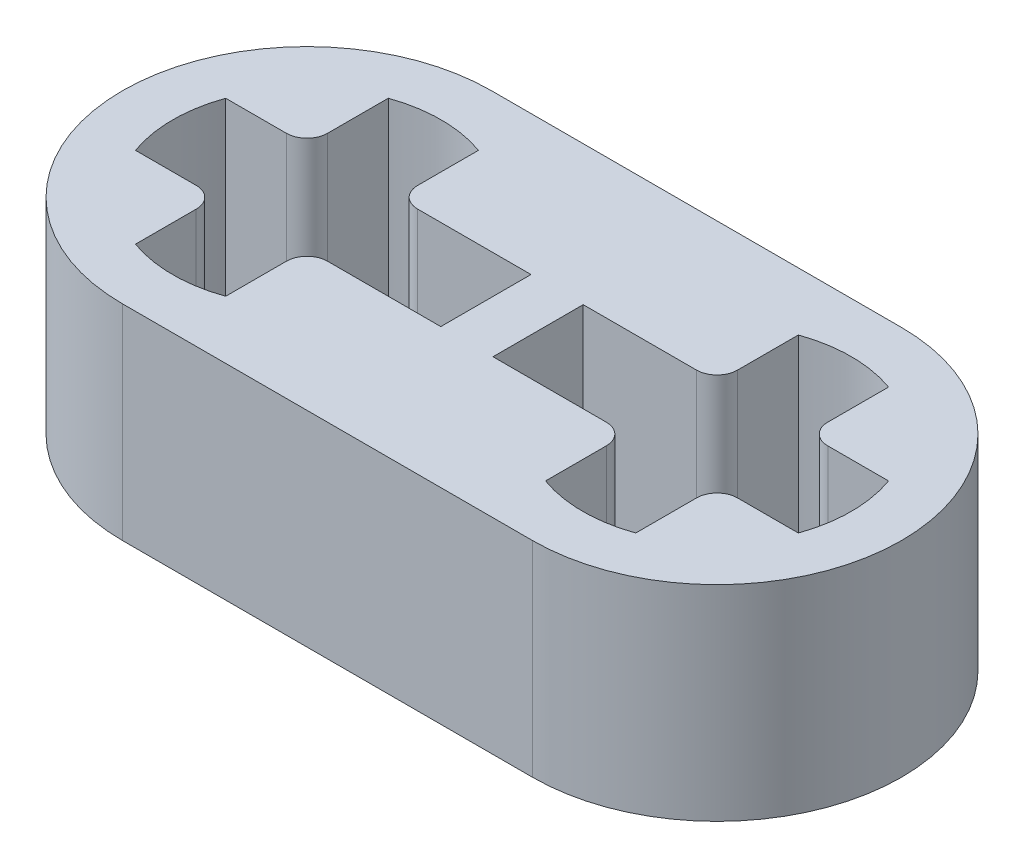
ISO-10303-21;
HEADER;
FILE_DESCRIPTION(('STEP AP214'),'2;1');
FILE_NAME('part.step','',(''),(''),'','','');
FILE_SCHEMA(('AUTOMOTIVE_DESIGN { 1 0 10303 214 1 1 1 1 }'));
ENDSEC;
DATA;
#1=APPLICATION_CONTEXT('core data for automotive mechanical design processes');
#2=APPLICATION_PROTOCOL_DEFINITION('international standard','automotive_design',2000,#1);
#3=PRODUCT_CONTEXT('',#1,'mechanical');
#4=PRODUCT('Part','Part','',(#3));
#5=PRODUCT_RELATED_PRODUCT_CATEGORY('part','',(#4));
#6=PRODUCT_DEFINITION_FORMATION('','',#4);
#7=PRODUCT_DEFINITION_CONTEXT('part definition',#1,'design');
#8=PRODUCT_DEFINITION('design','',#6,#7);
#9=PRODUCT_DEFINITION_SHAPE('','',#8);
#10=(LENGTH_UNIT() NAMED_UNIT(*) SI_UNIT(.MILLI.,.METRE.));
#11=(NAMED_UNIT(*) PLANE_ANGLE_UNIT() SI_UNIT($,.RADIAN.));
#12=(NAMED_UNIT(*) SI_UNIT($,.STERADIAN.) SOLID_ANGLE_UNIT());
#13=UNCERTAINTY_MEASURE_WITH_UNIT(LENGTH_MEASURE(1.E-05),#10,'distance_accuracy_value','');
#14=(GEOMETRIC_REPRESENTATION_CONTEXT(3) GLOBAL_UNCERTAINTY_ASSIGNED_CONTEXT((#13)) GLOBAL_UNIT_ASSIGNED_CONTEXT((#10,
#11,#12)) REPRESENTATION_CONTEXT('',''));
#15=CARTESIAN_POINT('',(0.,0.,0.));
#16=DIRECTION('',(0.,0.,1.));
#17=DIRECTION('',(1.,0.,0.));
#18=AXIS2_PLACEMENT_3D('',#15,#16,#17);
#19=CARTESIAN_POINT('',(-4.,4.,0.));
#20=DIRECTION('',(0.,-1.,0.));
#21=DIRECTION('',(0.,0.,-1.));
#22=AXIS2_PLACEMENT_3D('',#19,#20,#21);
#23=CYLINDRICAL_SURFACE('',#22,3.6);
#24=CARTESIAN_POINT('',(-4.,0.,0.));
#25=DIRECTION('',(0.,-1.,0.));
#26=DIRECTION('',(0.,0.,-1.));
#27=AXIS2_PLACEMENT_3D('',#24,#25,#26);
#28=CIRCLE('',#27,3.6);
#29=CARTESIAN_POINT('',(-4.,0.,3.6));
#30=VERTEX_POINT('',#29);
#31=CARTESIAN_POINT('',(-4.,0.,-3.6));
#32=VERTEX_POINT('',#31);
#33=EDGE_CURVE('E429',#30,#32,#28,.T.);
#34=ORIENTED_EDGE('',*,*,#33,.F.);
#35=DIRECTION('',(0.,-1.,0.));
#36=VECTOR('',#35,1.);
#37=CARTESIAN_POINT('',(-4.,4.,3.6));
#38=LINE('',#37,#36);
#39=CARTESIAN_POINT('',(-4.,4.,3.6));
#40=VERTEX_POINT('',#39);
#41=EDGE_CURVE('E471',#40,#30,#38,.T.);
#42=ORIENTED_EDGE('',*,*,#41,.F.);
#43=CARTESIAN_POINT('',(-4.,4.,0.));
#44=DIRECTION('',(0.,-1.,0.));
#45=DIRECTION('',(0.,0.,-1.));
#46=AXIS2_PLACEMENT_3D('',#43,#44,#45);
#47=CIRCLE('',#46,3.6);
#48=CARTESIAN_POINT('',(-4.,4.,-3.6));
#49=VERTEX_POINT('',#48);
#50=EDGE_CURVE('E447',#40,#49,#47,.T.);
#51=ORIENTED_EDGE('',*,*,#50,.T.);
#52=DIRECTION('',(0.,-1.,0.));
#53=VECTOR('',#52,1.);
#54=CARTESIAN_POINT('',(-4.,4.,-3.6));
#55=LINE('',#54,#53);
#56=EDGE_CURVE('E460',#49,#32,#55,.T.);
#57=ORIENTED_EDGE('',*,*,#56,.T.);
#58=EDGE_LOOP('',(#34,#42,#51,#57));
#59=FACE_BOUND('',#58,.T.);
#60=ADVANCED_FACE('F33',(#59),#23,.T.);
#61=CARTESIAN_POINT('',(4.,4.,3.6));
#62=DIRECTION('',(0.,0.,1.));
#63=DIRECTION('',(1.,0.,0.));
#64=AXIS2_PLACEMENT_3D('',#61,#62,#63);
#65=PLANE('',#64);
#66=DIRECTION('',(-1.,0.,0.));
#67=VECTOR('',#66,1.);
#68=CARTESIAN_POINT('',(4.,0.,3.6));
#69=LINE('',#68,#67);
#70=CARTESIAN_POINT('',(4.,0.,3.6));
#71=VERTEX_POINT('',#70);
#72=EDGE_CURVE('E451',#71,#30,#69,.T.);
#73=ORIENTED_EDGE('',*,*,#72,.F.);
#74=DIRECTION('',(0.,-1.,0.));
#75=VECTOR('',#74,1.);
#76=CARTESIAN_POINT('',(4.,4.,3.6));
#77=LINE('',#76,#75);
#78=CARTESIAN_POINT('',(4.,4.,3.6));
#79=VERTEX_POINT('',#78);
#80=EDGE_CURVE('E474',#79,#71,#77,.T.);
#81=ORIENTED_EDGE('',*,*,#80,.F.);
#82=DIRECTION('',(-1.,0.,0.));
#83=VECTOR('',#82,1.);
#84=CARTESIAN_POINT('',(4.,4.,3.6));
#85=LINE('',#84,#83);
#86=EDGE_CURVE('E457',#79,#40,#85,.T.);
#87=ORIENTED_EDGE('',*,*,#86,.T.);
#88=ORIENTED_EDGE('',*,*,#41,.T.);
#89=EDGE_LOOP('',(#73,#81,#87,#88));
#90=FACE_BOUND('',#89,.T.);
#91=ADVANCED_FACE('F616',(#90),#65,.T.);
#92=CARTESIAN_POINT('',(4.,4.,0.));
#93=DIRECTION('',(0.,-1.,0.));
#94=DIRECTION('',(0.,0.,-1.));
#95=AXIS2_PLACEMENT_3D('',#92,#93,#94);
#96=CYLINDRICAL_SURFACE('',#95,3.6);
#97=CARTESIAN_POINT('',(4.,0.,0.));
#98=DIRECTION('',(0.,-1.,0.));
#99=DIRECTION('',(0.,0.,-1.));
#100=AXIS2_PLACEMENT_3D('',#97,#98,#99);
#101=CIRCLE('',#100,3.6);
#102=CARTESIAN_POINT('',(4.,0.,-3.6));
#103=VERTEX_POINT('',#102);
#104=EDGE_CURVE('E466',#103,#71,#101,.T.);
#105=ORIENTED_EDGE('',*,*,#104,.F.);
#106=DIRECTION('',(0.,-1.,0.));
#107=VECTOR('',#106,1.);
#108=CARTESIAN_POINT('',(4.,4.,-3.6));
#109=LINE('',#108,#107);
#110=CARTESIAN_POINT('',(4.,4.,-3.6));
#111=VERTEX_POINT('',#110);
#112=EDGE_CURVE('E476',#111,#103,#109,.T.);
#113=ORIENTED_EDGE('',*,*,#112,.F.);
#114=CARTESIAN_POINT('',(4.,4.,0.));
#115=DIRECTION('',(0.,-1.,0.));
#116=DIRECTION('',(0.,0.,-1.));
#117=AXIS2_PLACEMENT_3D('',#114,#115,#116);
#118=CIRCLE('',#117,3.6);
#119=EDGE_CURVE('E454',#111,#79,#118,.T.);
#120=ORIENTED_EDGE('',*,*,#119,.T.);
#121=ORIENTED_EDGE('',*,*,#80,.T.);
#122=EDGE_LOOP('',(#105,#113,#120,#121));
#123=FACE_BOUND('',#122,.T.);
#124=ADVANCED_FACE('F622',(#123),#96,.T.);
#125=CARTESIAN_POINT('',(-4.,4.,-3.6));
#126=DIRECTION('',(0.,0.,-1.));
#127=DIRECTION('',(-1.,0.,0.));
#128=AXIS2_PLACEMENT_3D('',#125,#126,#127);
#129=PLANE('',#128);
#130=DIRECTION('',(1.,0.,0.));
#131=VECTOR('',#130,1.);
#132=CARTESIAN_POINT('',(-4.,0.,-3.6));
#133=LINE('',#132,#131);
#134=EDGE_CURVE('E463',#32,#103,#133,.T.);
#135=ORIENTED_EDGE('',*,*,#134,.F.);
#136=ORIENTED_EDGE('',*,*,#56,.F.);
#137=DIRECTION('',(1.,0.,0.));
#138=VECTOR('',#137,1.);
#139=CARTESIAN_POINT('',(-4.,4.,-3.6));
#140=LINE('',#139,#138);
#141=EDGE_CURVE('E450',#49,#111,#140,.T.);
#142=ORIENTED_EDGE('',*,*,#141,.T.);
#143=ORIENTED_EDGE('',*,*,#112,.T.);
#144=EDGE_LOOP('',(#135,#136,#142,#143));
#145=FACE_BOUND('',#144,.T.);
#146=ADVANCED_FACE('F628',(#145),#129,.T.);
#147=CARTESIAN_POINT('',(-4.,4.,0.));
#148=DIRECTION('',(0.,-1.,0.));
#149=DIRECTION('',(0.,0.,-1.));
#150=AXIS2_PLACEMENT_3D('',#147,#148,#149);
#151=PLANE('',#150);
#152=DIRECTION('',(0.,0.,1.));
#153=VECTOR('',#152,1.);
#154=CARTESIAN_POINT('',(3.12,4.,0.88));
#155=LINE('',#154,#153);
#156=CARTESIAN_POINT('',(3.12,4.,1.28));
#157=VERTEX_POINT('',#156);
#158=CARTESIAN_POINT('',(3.12,4.,2.46585515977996));
#159=VERTEX_POINT('',#158);
#160=EDGE_CURVE('E325',#157,#159,#155,.T.);
#161=ORIENTED_EDGE('',*,*,#160,.F.);
#162=CARTESIAN_POINT('',(2.72,4.,1.28));
#163=DIRECTION('',(0.,-1.,0.));
#164=DIRECTION('',(0.,0.,-1.));
#165=AXIS2_PLACEMENT_3D('',#162,#163,#164);
#166=CIRCLE('',#165,0.4);
#167=CARTESIAN_POINT('',(2.72,4.,0.88));
#168=VERTEX_POINT('',#167);
#169=EDGE_CURVE('E510',#157,#168,#166,.F.);
#170=ORIENTED_EDGE('',*,*,#169,.T.);
#171=DIRECTION('',(1.,0.,0.));
#172=VECTOR('',#171,1.);
#173=CARTESIAN_POINT('',(0.509212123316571,4.,0.880000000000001));
#174=LINE('',#173,#172);
#175=CARTESIAN_POINT('',(0.509212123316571,4.,0.880000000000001));
#176=VERTEX_POINT('',#175);
#177=EDGE_CURVE('E323',#176,#168,#174,.T.);
#178=ORIENTED_EDGE('',*,*,#177,.F.);
#179=DIRECTION('',(0.,0.,1.));
#180=VECTOR('',#179,1.);
#181=CARTESIAN_POINT('',(0.509212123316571,4.,0.880000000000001));
#182=LINE('',#181,#180);
#183=CARTESIAN_POINT('',(0.509212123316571,4.,-0.88));
#184=VERTEX_POINT('',#183);
#185=EDGE_CURVE('E273',#184,#176,#182,.T.);
#186=ORIENTED_EDGE('',*,*,#185,.F.);
#187=DIRECTION('',(-1.,0.,0.));
#188=VECTOR('',#187,1.);
#189=CARTESIAN_POINT('',(3.12,4.,-0.88));
#190=LINE('',#189,#188);
#191=CARTESIAN_POINT('',(2.72,4.,-0.88));
#192=VERTEX_POINT('',#191);
#193=EDGE_CURVE('E293',#192,#184,#190,.T.);
#194=ORIENTED_EDGE('',*,*,#193,.F.);
#195=CARTESIAN_POINT('',(2.72,4.,-1.28));
#196=DIRECTION('',(0.,-1.,0.));
#197=DIRECTION('',(0.,0.,-1.));
#198=AXIS2_PLACEMENT_3D('',#195,#196,#197);
#199=CIRCLE('',#198,0.4);
#200=CARTESIAN_POINT('',(3.12,4.,-1.28));
#201=VERTEX_POINT('',#200);
#202=EDGE_CURVE('E508',#192,#201,#199,.F.);
#203=ORIENTED_EDGE('',*,*,#202,.T.);
#204=DIRECTION('',(0.,0.,1.));
#205=VECTOR('',#204,1.);
#206=CARTESIAN_POINT('',(3.12,4.,-2.46585515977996));
#207=LINE('',#206,#205);
#208=CARTESIAN_POINT('',(3.12,4.,-2.46585515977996));
#209=VERTEX_POINT('',#208);
#210=EDGE_CURVE('E295',#209,#201,#207,.T.);
#211=ORIENTED_EDGE('',*,*,#210,.F.);
#212=CARTESIAN_POINT('',(4.,4.,0.));
#213=DIRECTION('',(0.,1.,0.));
#214=DIRECTION('',(0.,0.,1.));
#215=AXIS2_PLACEMENT_3D('',#212,#213,#214);
#216=CIRCLE('',#215,2.61817525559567);
#217=CARTESIAN_POINT('',(4.88,4.,-2.46585515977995));
#218=VERTEX_POINT('',#217);
#219=EDGE_CURVE('E343',#218,#209,#216,.T.);
#220=ORIENTED_EDGE('',*,*,#219,.F.);
#221=DIRECTION('',(0.,0.,-1.));
#222=VECTOR('',#221,1.);
#223=CARTESIAN_POINT('',(4.88,4.,-0.88));
#224=LINE('',#223,#222);
#225=CARTESIAN_POINT('',(4.88,4.,-1.28));
#226=VERTEX_POINT('',#225);
#227=EDGE_CURVE('E341',#226,#218,#224,.T.);
#228=ORIENTED_EDGE('',*,*,#227,.F.);
#229=CARTESIAN_POINT('',(5.28,4.,-1.28));
#230=DIRECTION('',(0.,-1.,0.));
#231=DIRECTION('',(0.,0.,-1.));
#232=AXIS2_PLACEMENT_3D('',#229,#230,#231);
#233=CIRCLE('',#232,0.4);
#234=CARTESIAN_POINT('',(5.28,4.,-0.88));
#235=VERTEX_POINT('',#234);
#236=EDGE_CURVE('E500',#226,#235,#233,.F.);
#237=ORIENTED_EDGE('',*,*,#236,.T.);
#238=DIRECTION('',(-1.,0.,0.));
#239=VECTOR('',#238,1.);
#240=CARTESIAN_POINT('',(6.46585515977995,4.,-0.88));
#241=LINE('',#240,#239);
#242=CARTESIAN_POINT('',(6.46585515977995,4.,-0.88));
#243=VERTEX_POINT('',#242);
#244=EDGE_CURVE('E338',#243,#235,#241,.T.);
#245=ORIENTED_EDGE('',*,*,#244,.F.);
#246=CARTESIAN_POINT('',(4.,4.,0.));
#247=DIRECTION('',(0.,1.,0.));
#248=DIRECTION('',(0.,0.,1.));
#249=AXIS2_PLACEMENT_3D('',#246,#247,#248);
#250=CIRCLE('',#249,2.61817525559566);
#251=CARTESIAN_POINT('',(6.46585515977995,4.,0.88));
#252=VERTEX_POINT('',#251);
#253=EDGE_CURVE('E335',#252,#243,#250,.T.);
#254=ORIENTED_EDGE('',*,*,#253,.F.);
#255=DIRECTION('',(1.,0.,0.));
#256=VECTOR('',#255,1.);
#257=CARTESIAN_POINT('',(4.88,4.,0.88));
#258=LINE('',#257,#256);
#259=CARTESIAN_POINT('',(5.28,4.,0.88));
#260=VERTEX_POINT('',#259);
#261=EDGE_CURVE('E333',#260,#252,#258,.T.);
#262=ORIENTED_EDGE('',*,*,#261,.F.);
#263=CARTESIAN_POINT('',(5.28,4.,1.28));
#264=DIRECTION('',(0.,-1.,0.));
#265=DIRECTION('',(0.,0.,-1.));
#266=AXIS2_PLACEMENT_3D('',#263,#264,#265);
#267=CIRCLE('',#266,0.4);
#268=CARTESIAN_POINT('',(4.88,4.,1.28));
#269=VERTEX_POINT('',#268);
#270=EDGE_CURVE('E506',#260,#269,#267,.F.);
#271=ORIENTED_EDGE('',*,*,#270,.T.);
#272=DIRECTION('',(0.,0.,-1.));
#273=VECTOR('',#272,1.);
#274=CARTESIAN_POINT('',(4.88,4.,2.46585515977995));
#275=LINE('',#274,#273);
#276=CARTESIAN_POINT('',(4.88,4.,2.46585515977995));
#277=VERTEX_POINT('',#276);
#278=EDGE_CURVE('E330',#277,#269,#275,.T.);
#279=ORIENTED_EDGE('',*,*,#278,.F.);
#280=CARTESIAN_POINT('',(4.,4.,0.));
#281=DIRECTION('',(0.,1.,0.));
#282=DIRECTION('',(0.,0.,1.));
#283=AXIS2_PLACEMENT_3D('',#280,#281,#282);
#284=CIRCLE('',#283,2.61817525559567);
#285=EDGE_CURVE('E327',#159,#277,#284,.T.);
#286=ORIENTED_EDGE('',*,*,#285,.F.);
#287=EDGE_LOOP('',(#161,#170,#178,#186,#194,#203,#211,#220,#228,#237,#245,#254,#262,#271,#279,#286));
#288=FACE_BOUND('',#287,.T.);
#289=DIRECTION('',(0.,0.,1.));
#290=VECTOR('',#289,1.);
#291=CARTESIAN_POINT('',(-3.12,4.,-2.46585515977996));
#292=LINE('',#291,#290);
#293=CARTESIAN_POINT('',(-3.12,4.,-2.46585515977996));
#294=VERTEX_POINT('',#293);
#295=CARTESIAN_POINT('',(-3.12,4.,-1.28));
#296=VERTEX_POINT('',#295);
#297=EDGE_CURVE('E392',#294,#296,#292,.T.);
#298=ORIENTED_EDGE('',*,*,#297,.T.);
#299=CARTESIAN_POINT('',(-2.72,4.,-1.28));
#300=DIRECTION('',(0.,-1.,0.));
#301=DIRECTION('',(0.,0.,-1.));
#302=AXIS2_PLACEMENT_3D('',#299,#300,#301);
#303=CIRCLE('',#302,0.4);
#304=CARTESIAN_POINT('',(-2.72,4.,-0.88));
#305=VERTEX_POINT('',#304);
#306=EDGE_CURVE('E512',#296,#305,#303,.F.);
#307=ORIENTED_EDGE('',*,*,#306,.T.);
#308=DIRECTION('',(1.,0.,0.));
#309=VECTOR('',#308,1.);
#310=CARTESIAN_POINT('',(-3.12,4.,-0.88));
#311=LINE('',#310,#309);
#312=CARTESIAN_POINT('',(-0.509212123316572,4.,-0.88));
#313=VERTEX_POINT('',#312);
#314=EDGE_CURVE('E395',#305,#313,#311,.T.);
#315=ORIENTED_EDGE('',*,*,#314,.T.);
#316=DIRECTION('',(0.,0.,1.));
#317=VECTOR('',#316,1.);
#318=CARTESIAN_POINT('',(-0.509212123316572,4.,-0.88));
#319=LINE('',#318,#317);
#320=CARTESIAN_POINT('',(-0.509212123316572,4.,0.880000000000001));
#321=VERTEX_POINT('',#320);
#322=EDGE_CURVE('E365',#313,#321,#319,.T.);
#323=ORIENTED_EDGE('',*,*,#322,.T.);
#324=DIRECTION('',(-1.,0.,0.));
#325=VECTOR('',#324,1.);
#326=CARTESIAN_POINT('',(-0.509212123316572,4.,0.880000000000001));
#327=LINE('',#326,#325);
#328=CARTESIAN_POINT('',(-2.72,4.,0.880000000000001));
#329=VERTEX_POINT('',#328);
#330=EDGE_CURVE('E368',#321,#329,#327,.T.);
#331=ORIENTED_EDGE('',*,*,#330,.T.);
#332=CARTESIAN_POINT('',(-2.72,4.,1.28));
#333=DIRECTION('',(0.,-1.,0.));
#334=DIRECTION('',(0.,0.,-1.));
#335=AXIS2_PLACEMENT_3D('',#332,#333,#334);
#336=CIRCLE('',#335,0.4);
#337=CARTESIAN_POINT('',(-3.12,4.,1.28));
#338=VERTEX_POINT('',#337);
#339=EDGE_CURVE('E504',#329,#338,#336,.F.);
#340=ORIENTED_EDGE('',*,*,#339,.T.);
#341=DIRECTION('',(0.,0.,1.));
#342=VECTOR('',#341,1.);
#343=CARTESIAN_POINT('',(-3.12,4.,0.880000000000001));
#344=LINE('',#343,#342);
#345=CARTESIAN_POINT('',(-3.12,4.,2.46585515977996));
#346=VERTEX_POINT('',#345);
#347=EDGE_CURVE('E372',#338,#346,#344,.T.);
#348=ORIENTED_EDGE('',*,*,#347,.T.);
#349=CARTESIAN_POINT('',(-4.,4.,0.));
#350=DIRECTION('',(0.,-1.,0.));
#351=DIRECTION('',(0.,0.,-1.));
#352=AXIS2_PLACEMENT_3D('',#349,#350,#351);
#353=CIRCLE('',#352,2.61817525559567);
#354=CARTESIAN_POINT('',(-4.88,4.,2.46585515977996));
#355=VERTEX_POINT('',#354);
#356=EDGE_CURVE('E374',#346,#355,#353,.T.);
#357=ORIENTED_EDGE('',*,*,#356,.T.);
#358=DIRECTION('',(0.,0.,-1.));
#359=VECTOR('',#358,1.);
#360=CARTESIAN_POINT('',(-4.88,4.,2.46585515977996));
#361=LINE('',#360,#359);
#362=CARTESIAN_POINT('',(-4.88,4.,1.28));
#363=VERTEX_POINT('',#362);
#364=EDGE_CURVE('E377',#355,#363,#361,.T.);
#365=ORIENTED_EDGE('',*,*,#364,.T.);
#366=CARTESIAN_POINT('',(-5.28,4.,1.28));
#367=DIRECTION('',(0.,-1.,0.));
#368=DIRECTION('',(0.,0.,-1.));
#369=AXIS2_PLACEMENT_3D('',#366,#367,#368);
#370=CIRCLE('',#369,0.4);
#371=CARTESIAN_POINT('',(-5.28,4.,0.880000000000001));
#372=VERTEX_POINT('',#371);
#373=EDGE_CURVE('E502',#363,#372,#370,.F.);
#374=ORIENTED_EDGE('',*,*,#373,.T.);
#375=DIRECTION('',(-1.,0.,0.));
#376=VECTOR('',#375,1.);
#377=CARTESIAN_POINT('',(-4.88,4.,0.880000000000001));
#378=LINE('',#377,#376);
#379=CARTESIAN_POINT('',(-6.46585515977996,4.,0.88));
#380=VERTEX_POINT('',#379);
#381=EDGE_CURVE('E380',#372,#380,#378,.T.);
#382=ORIENTED_EDGE('',*,*,#381,.T.);
#383=CARTESIAN_POINT('',(-4.,4.,0.));
#384=DIRECTION('',(0.,-1.,0.));
#385=DIRECTION('',(0.,0.,-1.));
#386=AXIS2_PLACEMENT_3D('',#383,#384,#385);
#387=CIRCLE('',#386,2.61817525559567);
#388=CARTESIAN_POINT('',(-6.46585515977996,4.,-0.88));
#389=VERTEX_POINT('',#388);
#390=EDGE_CURVE('E382',#380,#389,#387,.T.);
#391=ORIENTED_EDGE('',*,*,#390,.T.);
#392=DIRECTION('',(1.,0.,0.));
#393=VECTOR('',#392,1.);
#394=CARTESIAN_POINT('',(-6.46585515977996,4.,-0.88));
#395=LINE('',#394,#393);
#396=CARTESIAN_POINT('',(-5.28,4.,-0.88));
#397=VERTEX_POINT('',#396);
#398=EDGE_CURVE('E385',#389,#397,#395,.T.);
#399=ORIENTED_EDGE('',*,*,#398,.T.);
#400=CARTESIAN_POINT('',(-5.28,4.,-1.28));
#401=DIRECTION('',(0.,-1.,0.));
#402=DIRECTION('',(0.,0.,-1.));
#403=AXIS2_PLACEMENT_3D('',#400,#401,#402);
#404=CIRCLE('',#403,0.4);
#405=CARTESIAN_POINT('',(-4.88,4.,-1.28));
#406=VERTEX_POINT('',#405);
#407=EDGE_CURVE('E48',#397,#406,#404,.F.);
#408=ORIENTED_EDGE('',*,*,#407,.T.);
#409=DIRECTION('',(0.,0.,-1.));
#410=VECTOR('',#409,1.);
#411=CARTESIAN_POINT('',(-4.88,4.,-0.88));
#412=LINE('',#411,#410);
#413=CARTESIAN_POINT('',(-4.88,4.,-2.46585515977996));
#414=VERTEX_POINT('',#413);
#415=EDGE_CURVE('E387',#406,#414,#412,.T.);
#416=ORIENTED_EDGE('',*,*,#415,.T.);
#417=CARTESIAN_POINT('',(-4.,4.,0.));
#418=DIRECTION('',(0.,-1.,0.));
#419=DIRECTION('',(0.,0.,-1.));
#420=AXIS2_PLACEMENT_3D('',#417,#418,#419);
#421=CIRCLE('',#420,2.61817525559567);
#422=EDGE_CURVE('E389',#414,#294,#421,.T.);
#423=ORIENTED_EDGE('',*,*,#422,.T.);
#424=EDGE_LOOP('',(#298,#307,#315,#323,#331,#340,#348,#357,#365,#374,#382,#391,#399,#408,#416,#423));
#425=FACE_BOUND('',#424,.T.);
#426=ORIENTED_EDGE('',*,*,#50,.F.);
#427=ORIENTED_EDGE('',*,*,#86,.F.);
#428=ORIENTED_EDGE('',*,*,#119,.F.);
#429=ORIENTED_EDGE('',*,*,#141,.F.);
#430=EDGE_LOOP('',(#426,#427,#428,#429));
#431=FACE_BOUND('',#430,.T.);
#432=ADVANCED_FACE('F558',(#288,#425,#431),#151,.F.);
#433=CARTESIAN_POINT('',(-4.,0.,0.));
#434=DIRECTION('',(0.,-1.,0.));
#435=DIRECTION('',(0.,0.,-1.));
#436=AXIS2_PLACEMENT_3D('',#433,#434,#435);
#437=PLANE('',#436);
#438=DIRECTION('',(1.,0.,0.));
#439=VECTOR('',#438,1.);
#440=CARTESIAN_POINT('',(0.509212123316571,0.,0.880000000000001));
#441=LINE('',#440,#439);
#442=CARTESIAN_POINT('',(0.509212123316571,0.,0.880000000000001));
#443=VERTEX_POINT('',#442);
#444=CARTESIAN_POINT('',(2.72,0.,0.88));
#445=VERTEX_POINT('',#444);
#446=EDGE_CURVE('E281',#443,#445,#441,.T.);
#447=ORIENTED_EDGE('',*,*,#446,.T.);
#448=CARTESIAN_POINT('',(2.72,0.,1.28));
#449=DIRECTION('',(0.,-1.,0.));
#450=DIRECTION('',(0.,0.,-1.));
#451=AXIS2_PLACEMENT_3D('',#448,#449,#450);
#452=CIRCLE('',#451,0.4);
#453=CARTESIAN_POINT('',(3.12,0.,1.28));
#454=VERTEX_POINT('',#453);
#455=EDGE_CURVE('E493',#445,#454,#452,.T.);
#456=ORIENTED_EDGE('',*,*,#455,.T.);
#457=DIRECTION('',(0.,0.,1.));
#458=VECTOR('',#457,1.);
#459=CARTESIAN_POINT('',(3.12,0.,0.88));
#460=LINE('',#459,#458);
#461=CARTESIAN_POINT('',(3.12,0.,2.46585515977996));
#462=VERTEX_POINT('',#461);
#463=EDGE_CURVE('E287',#454,#462,#460,.T.);
#464=ORIENTED_EDGE('',*,*,#463,.T.);
#465=CARTESIAN_POINT('',(4.,0.,0.));
#466=DIRECTION('',(0.,1.,0.));
#467=DIRECTION('',(0.,0.,1.));
#468=AXIS2_PLACEMENT_3D('',#465,#466,#467);
#469=CIRCLE('',#468,2.61817525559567);
#470=CARTESIAN_POINT('',(4.88,0.,2.46585515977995));
#471=VERTEX_POINT('',#470);
#472=EDGE_CURVE('E299',#462,#471,#469,.T.);
#473=ORIENTED_EDGE('',*,*,#472,.T.);
#474=DIRECTION('',(0.,0.,-1.));
#475=VECTOR('',#474,1.);
#476=CARTESIAN_POINT('',(4.88,0.,2.46585515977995));
#477=LINE('',#476,#475);
#478=CARTESIAN_POINT('',(4.88,0.,1.28));
#479=VERTEX_POINT('',#478);
#480=EDGE_CURVE('E302',#471,#479,#477,.T.);
#481=ORIENTED_EDGE('',*,*,#480,.T.);
#482=CARTESIAN_POINT('',(5.28,0.,1.28));
#483=DIRECTION('',(0.,-1.,0.));
#484=DIRECTION('',(0.,0.,-1.));
#485=AXIS2_PLACEMENT_3D('',#482,#483,#484);
#486=CIRCLE('',#485,0.4);
#487=CARTESIAN_POINT('',(5.28,0.,0.88));
#488=VERTEX_POINT('',#487);
#489=EDGE_CURVE('E489',#479,#488,#486,.T.);
#490=ORIENTED_EDGE('',*,*,#489,.T.);
#491=DIRECTION('',(1.,0.,0.));
#492=VECTOR('',#491,1.);
#493=CARTESIAN_POINT('',(4.88,0.,0.88));
#494=LINE('',#493,#492);
#495=CARTESIAN_POINT('',(6.46585515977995,0.,0.88));
#496=VERTEX_POINT('',#495);
#497=EDGE_CURVE('E305',#488,#496,#494,.T.);
#498=ORIENTED_EDGE('',*,*,#497,.T.);
#499=CARTESIAN_POINT('',(4.,0.,0.));
#500=DIRECTION('',(0.,1.,0.));
#501=DIRECTION('',(0.,0.,1.));
#502=AXIS2_PLACEMENT_3D('',#499,#500,#501);
#503=CIRCLE('',#502,2.61817525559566);
#504=CARTESIAN_POINT('',(6.46585515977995,0.,-0.88));
#505=VERTEX_POINT('',#504);
#506=EDGE_CURVE('E307',#496,#505,#503,.T.);
#507=ORIENTED_EDGE('',*,*,#506,.T.);
#508=DIRECTION('',(-1.,0.,0.));
#509=VECTOR('',#508,1.);
#510=CARTESIAN_POINT('',(6.46585515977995,0.,-0.88));
#511=LINE('',#510,#509);
#512=CARTESIAN_POINT('',(5.28,0.,-0.88));
#513=VERTEX_POINT('',#512);
#514=EDGE_CURVE('E310',#505,#513,#511,.T.);
#515=ORIENTED_EDGE('',*,*,#514,.T.);
#516=CARTESIAN_POINT('',(5.28,0.,-1.28));
#517=DIRECTION('',(0.,-1.,0.));
#518=DIRECTION('',(0.,0.,-1.));
#519=AXIS2_PLACEMENT_3D('',#516,#517,#518);
#520=CIRCLE('',#519,0.4);
#521=CARTESIAN_POINT('',(4.88,0.,-1.28));
#522=VERTEX_POINT('',#521);
#523=EDGE_CURVE('E483',#513,#522,#520,.T.);
#524=ORIENTED_EDGE('',*,*,#523,.T.);
#525=DIRECTION('',(0.,0.,-1.));
#526=VECTOR('',#525,1.);
#527=CARTESIAN_POINT('',(4.88,0.,-0.88));
#528=LINE('',#527,#526);
#529=CARTESIAN_POINT('',(4.88,0.,-2.46585515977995));
#530=VERTEX_POINT('',#529);
#531=EDGE_CURVE('E313',#522,#530,#528,.T.);
#532=ORIENTED_EDGE('',*,*,#531,.T.);
#533=CARTESIAN_POINT('',(4.,0.,0.));
#534=DIRECTION('',(0.,1.,0.));
#535=DIRECTION('',(0.,0.,1.));
#536=AXIS2_PLACEMENT_3D('',#533,#534,#535);
#537=CIRCLE('',#536,2.61817525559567);
#538=CARTESIAN_POINT('',(3.12,0.,-2.46585515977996));
#539=VERTEX_POINT('',#538);
#540=EDGE_CURVE('E315',#530,#539,#537,.T.);
#541=ORIENTED_EDGE('',*,*,#540,.T.);
#542=DIRECTION('',(0.,0.,1.));
#543=VECTOR('',#542,1.);
#544=CARTESIAN_POINT('',(3.12,0.,-2.46585515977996));
#545=LINE('',#544,#543);
#546=CARTESIAN_POINT('',(3.12,0.,-1.28));
#547=VERTEX_POINT('',#546);
#548=EDGE_CURVE('E318',#539,#547,#545,.T.);
#549=ORIENTED_EDGE('',*,*,#548,.T.);
#550=CARTESIAN_POINT('',(2.72,0.,-1.28));
#551=DIRECTION('',(0.,-1.,0.));
#552=DIRECTION('',(0.,0.,-1.));
#553=AXIS2_PLACEMENT_3D('',#550,#551,#552);
#554=CIRCLE('',#553,0.4);
#555=CARTESIAN_POINT('',(2.72,0.,-0.88));
#556=VERTEX_POINT('',#555);
#557=EDGE_CURVE('E491',#547,#556,#554,.T.);
#558=ORIENTED_EDGE('',*,*,#557,.T.);
#559=DIRECTION('',(-1.,0.,0.));
#560=VECTOR('',#559,1.);
#561=CARTESIAN_POINT('',(3.12,0.,-0.88));
#562=LINE('',#561,#560);
#563=CARTESIAN_POINT('',(0.509212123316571,0.,-0.88));
#564=VERTEX_POINT('',#563);
#565=EDGE_CURVE('E278',#556,#564,#562,.T.);
#566=ORIENTED_EDGE('',*,*,#565,.T.);
#567=DIRECTION('',(0.,0.,1.));
#568=VECTOR('',#567,1.);
#569=CARTESIAN_POINT('',(0.509212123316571,0.,0.880000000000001));
#570=LINE('',#569,#568);
#571=EDGE_CURVE('E271',#564,#443,#570,.T.);
#572=ORIENTED_EDGE('',*,*,#571,.T.);
#573=EDGE_LOOP('',(#447,#456,#464,#473,#481,#490,#498,#507,#515,#524,#532,#541,#549,#558,#566,#572));
#574=FACE_BOUND('',#573,.T.);
#575=DIRECTION('',(1.,0.,0.));
#576=VECTOR('',#575,1.);
#577=CARTESIAN_POINT('',(-3.12,0.,-0.88));
#578=LINE('',#577,#576);
#579=CARTESIAN_POINT('',(-2.72,0.,-0.88));
#580=VERTEX_POINT('',#579);
#581=CARTESIAN_POINT('',(-0.509212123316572,0.,-0.88));
#582=VERTEX_POINT('',#581);
#583=EDGE_CURVE('E369',#580,#582,#578,.T.);
#584=ORIENTED_EDGE('',*,*,#583,.F.);
#585=CARTESIAN_POINT('',(-2.72,0.,-1.28));
#586=DIRECTION('',(0.,-1.,0.));
#587=DIRECTION('',(0.,0.,-1.));
#588=AXIS2_PLACEMENT_3D('',#585,#586,#587);
#589=CIRCLE('',#588,0.4);
#590=CARTESIAN_POINT('',(-3.12,0.,-1.28));
#591=VERTEX_POINT('',#590);
#592=EDGE_CURVE('E495',#580,#591,#589,.T.);
#593=ORIENTED_EDGE('',*,*,#592,.T.);
#594=DIRECTION('',(0.,0.,1.));
#595=VECTOR('',#594,1.);
#596=CARTESIAN_POINT('',(-3.12,0.,-2.46585515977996));
#597=LINE('',#596,#595);
#598=CARTESIAN_POINT('',(-3.12,0.,-2.46585515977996));
#599=VERTEX_POINT('',#598);
#600=EDGE_CURVE('E422',#599,#591,#597,.T.);
#601=ORIENTED_EDGE('',*,*,#600,.F.);
#602=CARTESIAN_POINT('',(-4.,0.,0.));
#603=DIRECTION('',(0.,-1.,0.));
#604=DIRECTION('',(0.,0.,-1.));
#605=AXIS2_PLACEMENT_3D('',#602,#603,#604);
#606=CIRCLE('',#605,2.61817525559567);
#607=CARTESIAN_POINT('',(-4.88,0.,-2.46585515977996));
#608=VERTEX_POINT('',#607);
#609=EDGE_CURVE('E419',#608,#599,#606,.T.);
#610=ORIENTED_EDGE('',*,*,#609,.F.);
#611=DIRECTION('',(0.,0.,-1.));
#612=VECTOR('',#611,1.);
#613=CARTESIAN_POINT('',(-4.88,0.,-0.88));
#614=LINE('',#613,#612);
#615=CARTESIAN_POINT('',(-4.88,0.,-1.28));
#616=VERTEX_POINT('',#615);
#617=EDGE_CURVE('E417',#616,#608,#614,.T.);
#618=ORIENTED_EDGE('',*,*,#617,.F.);
#619=CARTESIAN_POINT('',(-5.28,0.,-1.28));
#620=DIRECTION('',(0.,-1.,0.));
#621=DIRECTION('',(0.,0.,-1.));
#622=AXIS2_PLACEMENT_3D('',#619,#620,#621);
#623=CIRCLE('',#622,0.4);
#624=CARTESIAN_POINT('',(-5.28,0.,-0.88));
#625=VERTEX_POINT('',#624);
#626=EDGE_CURVE('E481',#616,#625,#623,.T.);
#627=ORIENTED_EDGE('',*,*,#626,.T.);
#628=DIRECTION('',(1.,0.,0.));
#629=VECTOR('',#628,1.);
#630=CARTESIAN_POINT('',(-6.46585515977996,0.,-0.88));
#631=LINE('',#630,#629);
#632=CARTESIAN_POINT('',(-6.46585515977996,0.,-0.88));
#633=VERTEX_POINT('',#632);
#634=EDGE_CURVE('E415',#633,#625,#631,.T.);
#635=ORIENTED_EDGE('',*,*,#634,.F.);
#636=CARTESIAN_POINT('',(-4.,0.,0.));
#637=DIRECTION('',(0.,-1.,0.));
#638=DIRECTION('',(0.,0.,-1.));
#639=AXIS2_PLACEMENT_3D('',#636,#637,#638);
#640=CIRCLE('',#639,2.61817525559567);
#641=CARTESIAN_POINT('',(-6.46585515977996,0.,0.88));
#642=VERTEX_POINT('',#641);
#643=EDGE_CURVE('E412',#642,#633,#640,.T.);
#644=ORIENTED_EDGE('',*,*,#643,.F.);
#645=DIRECTION('',(-1.,0.,0.));
#646=VECTOR('',#645,1.);
#647=CARTESIAN_POINT('',(-4.88,0.,0.880000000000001));
#648=LINE('',#647,#646);
#649=CARTESIAN_POINT('',(-5.28,0.,0.880000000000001));
#650=VERTEX_POINT('',#649);
#651=EDGE_CURVE('E410',#650,#642,#648,.T.);
#652=ORIENTED_EDGE('',*,*,#651,.F.);
#653=CARTESIAN_POINT('',(-5.28,0.,1.28));
#654=DIRECTION('',(0.,-1.,0.));
#655=DIRECTION('',(0.,0.,-1.));
#656=AXIS2_PLACEMENT_3D('',#653,#654,#655);
#657=CIRCLE('',#656,0.4);
#658=CARTESIAN_POINT('',(-4.88,0.,1.28));
#659=VERTEX_POINT('',#658);
#660=EDGE_CURVE('E485',#650,#659,#657,.T.);
#661=ORIENTED_EDGE('',*,*,#660,.T.);
#662=DIRECTION('',(0.,0.,-1.));
#663=VECTOR('',#662,1.);
#664=CARTESIAN_POINT('',(-4.88,0.,2.46585515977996));
#665=LINE('',#664,#663);
#666=CARTESIAN_POINT('',(-4.88,0.,2.46585515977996));
#667=VERTEX_POINT('',#666);
#668=EDGE_CURVE('E407',#667,#659,#665,.T.);
#669=ORIENTED_EDGE('',*,*,#668,.F.);
#670=CARTESIAN_POINT('',(-4.,0.,0.));
#671=DIRECTION('',(0.,-1.,0.));
#672=DIRECTION('',(0.,0.,-1.));
#673=AXIS2_PLACEMENT_3D('',#670,#671,#672);
#674=CIRCLE('',#673,2.61817525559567);
#675=CARTESIAN_POINT('',(-3.12,0.,2.46585515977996));
#676=VERTEX_POINT('',#675);
#677=EDGE_CURVE('E404',#676,#667,#674,.T.);
#678=ORIENTED_EDGE('',*,*,#677,.F.);
#679=DIRECTION('',(0.,0.,1.));
#680=VECTOR('',#679,1.);
#681=CARTESIAN_POINT('',(-3.12,0.,0.880000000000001));
#682=LINE('',#681,#680);
#683=CARTESIAN_POINT('',(-3.12,0.,1.28));
#684=VERTEX_POINT('',#683);
#685=EDGE_CURVE('E402',#684,#676,#682,.T.);
#686=ORIENTED_EDGE('',*,*,#685,.F.);
#687=CARTESIAN_POINT('',(-2.72,0.,1.28));
#688=DIRECTION('',(0.,-1.,0.));
#689=DIRECTION('',(0.,0.,-1.));
#690=AXIS2_PLACEMENT_3D('',#687,#688,#689);
#691=CIRCLE('',#690,0.4);
#692=CARTESIAN_POINT('',(-2.72,0.,0.880000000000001));
#693=VERTEX_POINT('',#692);
#694=EDGE_CURVE('E487',#684,#693,#691,.T.);
#695=ORIENTED_EDGE('',*,*,#694,.T.);
#696=DIRECTION('',(-1.,0.,0.));
#697=VECTOR('',#696,1.);
#698=CARTESIAN_POINT('',(-0.509212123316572,0.,0.880000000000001));
#699=LINE('',#698,#697);
#700=CARTESIAN_POINT('',(-0.509212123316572,0.,0.880000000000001));
#701=VERTEX_POINT('',#700);
#702=EDGE_CURVE('E399',#701,#693,#699,.T.);
#703=ORIENTED_EDGE('',*,*,#702,.F.);
#704=DIRECTION('',(0.,0.,1.));
#705=VECTOR('',#704,1.);
#706=CARTESIAN_POINT('',(-0.509212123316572,0.,-0.88));
#707=LINE('',#706,#705);
#708=EDGE_CURVE('E350',#582,#701,#707,.T.);
#709=ORIENTED_EDGE('',*,*,#708,.F.);
#710=EDGE_LOOP('',(#584,#593,#601,#610,#618,#627,#635,#644,#652,#661,#669,#678,#686,#695,#703,#709));
#711=FACE_BOUND('',#710,.T.);
#712=ORIENTED_EDGE('',*,*,#33,.T.);
#713=ORIENTED_EDGE('',*,*,#134,.T.);
#714=ORIENTED_EDGE('',*,*,#104,.T.);
#715=ORIENTED_EDGE('',*,*,#72,.T.);
#716=EDGE_LOOP('',(#712,#713,#714,#715));
#717=FACE_BOUND('',#716,.T.);
#718=ADVANCED_FACE('F289',(#574,#711,#717),#437,.T.);
#719=CARTESIAN_POINT('',(-0.509212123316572,4.,-0.88));
#720=DIRECTION('',(1.,0.,0.));
#721=DIRECTION('',(0.,0.,-1.));
#722=AXIS2_PLACEMENT_3D('',#719,#720,#721);
#723=PLANE('',#722);
#724=ORIENTED_EDGE('',*,*,#708,.T.);
#725=DIRECTION('',(0.,-1.,0.));
#726=VECTOR('',#725,1.);
#727=CARTESIAN_POINT('',(-0.509212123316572,4.,0.880000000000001));
#728=LINE('',#727,#726);
#729=EDGE_CURVE('E397',#321,#701,#728,.T.);
#730=ORIENTED_EDGE('',*,*,#729,.F.);
#731=ORIENTED_EDGE('',*,*,#322,.F.);
#732=DIRECTION('',(0.,-1.,0.));
#733=VECTOR('',#732,1.);
#734=CARTESIAN_POINT('',(-0.509212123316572,4.,-0.88));
#735=LINE('',#734,#733);
#736=EDGE_CURVE('E426',#313,#582,#735,.T.);
#737=ORIENTED_EDGE('',*,*,#736,.T.);
#738=EDGE_LOOP('',(#724,#730,#731,#737));
#739=FACE_BOUND('',#738,.T.);
#740=ADVANCED_FACE('F573',(#739),#723,.F.);
#741=CARTESIAN_POINT('',(-3.12,4.,-0.88));
#742=DIRECTION('',(0.,0.,-1.));
#743=DIRECTION('',(-1.,0.,0.));
#744=AXIS2_PLACEMENT_3D('',#741,#742,#743);
#745=PLANE('',#744);
#746=ORIENTED_EDGE('',*,*,#314,.F.);
#747=DIRECTION('',(0.,-1.,0.));
#748=VECTOR('',#747,1.);
#749=CARTESIAN_POINT('',(-2.72,4.,-0.88));
#750=LINE('',#749,#748);
#751=EDGE_CURVE('E473',#305,#580,#750,.T.);
#752=ORIENTED_EDGE('',*,*,#751,.T.);
#753=ORIENTED_EDGE('',*,*,#583,.T.);
#754=ORIENTED_EDGE('',*,*,#736,.F.);
#755=EDGE_LOOP('',(#746,#752,#753,#754));
#756=FACE_BOUND('',#755,.T.);
#757=ADVANCED_FACE('F568',(#756),#745,.F.);
#758=CARTESIAN_POINT('',(-3.12,4.,-2.46585515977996));
#759=DIRECTION('',(1.,0.,0.));
#760=DIRECTION('',(0.,0.,-1.));
#761=AXIS2_PLACEMENT_3D('',#758,#759,#760);
#762=PLANE('',#761);
#763=ORIENTED_EDGE('',*,*,#600,.T.);
#764=DIRECTION('',(0.,-1.,0.));
#765=VECTOR('',#764,1.);
#766=CARTESIAN_POINT('',(-3.12,4.,-1.28));
#767=LINE('',#766,#765);
#768=EDGE_CURVE('E497',#591,#296,#767,.F.);
#769=ORIENTED_EDGE('',*,*,#768,.T.);
#770=ORIENTED_EDGE('',*,*,#297,.F.);
#771=DIRECTION('',(0.,-1.,0.));
#772=VECTOR('',#771,1.);
#773=CARTESIAN_POINT('',(-3.12,4.,-2.46585515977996));
#774=LINE('',#773,#772);
#775=EDGE_CURVE('E430',#294,#599,#774,.T.);
#776=ORIENTED_EDGE('',*,*,#775,.T.);
#777=EDGE_LOOP('',(#763,#769,#770,#776));
#778=FACE_BOUND('',#777,.T.);
#779=ADVANCED_FACE('F859',(#778),#762,.F.);
#780=CARTESIAN_POINT('',(-4.,4.,0.));
#781=DIRECTION('',(0.,-1.,0.));
#782=DIRECTION('',(0.,0.,-1.));
#783=AXIS2_PLACEMENT_3D('',#780,#781,#782);
#784=CYLINDRICAL_SURFACE('',#783,2.61817525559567);
#785=ORIENTED_EDGE('',*,*,#609,.T.);
#786=ORIENTED_EDGE('',*,*,#775,.F.);
#787=ORIENTED_EDGE('',*,*,#422,.F.);
#788=DIRECTION('',(0.,-1.,0.));
#789=VECTOR('',#788,1.);
#790=CARTESIAN_POINT('',(-4.88,4.,-2.46585515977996));
#791=LINE('',#790,#789);
#792=EDGE_CURVE('E432',#414,#608,#791,.T.);
#793=ORIENTED_EDGE('',*,*,#792,.T.);
#794=EDGE_LOOP('',(#785,#786,#787,#793));
#795=FACE_BOUND('',#794,.T.);
#796=ADVANCED_FACE('F555',(#795),#784,.F.);
#797=CARTESIAN_POINT('',(-4.88,4.,-0.88));
#798=DIRECTION('',(-1.,0.,0.));
#799=DIRECTION('',(0.,0.,1.));
#800=AXIS2_PLACEMENT_3D('',#797,#798,#799);
#801=PLANE('',#800);
#802=ORIENTED_EDGE('',*,*,#415,.F.);
#803=DIRECTION('',(0.,-1.,0.));
#804=VECTOR('',#803,1.);
#805=CARTESIAN_POINT('',(-4.88,4.,-1.28));
#806=LINE('',#805,#804);
#807=EDGE_CURVE('E41',#406,#616,#806,.T.);
#808=ORIENTED_EDGE('',*,*,#807,.T.);
#809=ORIENTED_EDGE('',*,*,#617,.T.);
#810=ORIENTED_EDGE('',*,*,#792,.F.);
#811=EDGE_LOOP('',(#802,#808,#809,#810));
#812=FACE_BOUND('',#811,.T.);
#813=ADVANCED_FACE('F546',(#812),#801,.F.);
#814=CARTESIAN_POINT('',(-6.46585515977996,4.,-0.88));
#815=DIRECTION('',(0.,0.,-1.));
#816=DIRECTION('',(-1.,0.,0.));
#817=AXIS2_PLACEMENT_3D('',#814,#815,#816);
#818=PLANE('',#817);
#819=ORIENTED_EDGE('',*,*,#634,.T.);
#820=DIRECTION('',(0.,-1.,0.));
#821=VECTOR('',#820,1.);
#822=CARTESIAN_POINT('',(-5.28,4.,-0.88));
#823=LINE('',#822,#821);
#824=EDGE_CURVE('E11',#625,#397,#823,.F.);
#825=ORIENTED_EDGE('',*,*,#824,.T.);
#826=ORIENTED_EDGE('',*,*,#398,.F.);
#827=DIRECTION('',(0.,-1.,0.));
#828=VECTOR('',#827,1.);
#829=CARTESIAN_POINT('',(-6.46585515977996,4.,-0.88));
#830=LINE('',#829,#828);
#831=EDGE_CURVE('E435',#389,#633,#830,.T.);
#832=ORIENTED_EDGE('',*,*,#831,.T.);
#833=EDGE_LOOP('',(#819,#825,#826,#832));
#834=FACE_BOUND('',#833,.T.);
#835=ADVANCED_FACE('F837',(#834),#818,.F.);
#836=CARTESIAN_POINT('',(-4.,4.,0.));
#837=DIRECTION('',(0.,-1.,0.));
#838=DIRECTION('',(0.,0.,-1.));
#839=AXIS2_PLACEMENT_3D('',#836,#837,#838);
#840=CYLINDRICAL_SURFACE('',#839,2.61817525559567);
#841=ORIENTED_EDGE('',*,*,#643,.T.);
#842=ORIENTED_EDGE('',*,*,#831,.F.);
#843=ORIENTED_EDGE('',*,*,#390,.F.);
#844=DIRECTION('',(0.,-1.,0.));
#845=VECTOR('',#844,1.);
#846=CARTESIAN_POINT('',(-6.46585515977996,4.,0.88));
#847=LINE('',#846,#845);
#848=EDGE_CURVE('E437',#380,#642,#847,.T.);
#849=ORIENTED_EDGE('',*,*,#848,.T.);
#850=EDGE_LOOP('',(#841,#842,#843,#849));
#851=FACE_BOUND('',#850,.T.);
#852=ADVANCED_FACE('F607',(#851),#840,.F.);
#853=CARTESIAN_POINT('',(-4.88,4.,0.880000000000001));
#854=DIRECTION('',(0.,0.,1.));
#855=DIRECTION('',(1.,0.,0.));
#856=AXIS2_PLACEMENT_3D('',#853,#854,#855);
#857=PLANE('',#856);
#858=ORIENTED_EDGE('',*,*,#381,.F.);
#859=DIRECTION('',(0.,-1.,0.));
#860=VECTOR('',#859,1.);
#861=CARTESIAN_POINT('',(-5.28,4.,0.880000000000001));
#862=LINE('',#861,#860);
#863=EDGE_CURVE('E533',#372,#650,#862,.T.);
#864=ORIENTED_EDGE('',*,*,#863,.T.);
#865=ORIENTED_EDGE('',*,*,#651,.T.);
#866=ORIENTED_EDGE('',*,*,#848,.F.);
#867=EDGE_LOOP('',(#858,#864,#865,#866));
#868=FACE_BOUND('',#867,.T.);
#869=ADVANCED_FACE('F603',(#868),#857,.F.);
#870=CARTESIAN_POINT('',(-4.88,4.,2.46585515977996));
#871=DIRECTION('',(-1.,0.,0.));
#872=DIRECTION('',(0.,0.,1.));
#873=AXIS2_PLACEMENT_3D('',#870,#871,#872);
#874=PLANE('',#873);
#875=ORIENTED_EDGE('',*,*,#668,.T.);
#876=DIRECTION('',(0.,-1.,0.));
#877=VECTOR('',#876,1.);
#878=CARTESIAN_POINT('',(-4.88,4.,1.28));
#879=LINE('',#878,#877);
#880=EDGE_CURVE('E536',#659,#363,#879,.F.);
#881=ORIENTED_EDGE('',*,*,#880,.T.);
#882=ORIENTED_EDGE('',*,*,#364,.F.);
#883=DIRECTION('',(0.,-1.,0.));
#884=VECTOR('',#883,1.);
#885=CARTESIAN_POINT('',(-4.88,4.,2.46585515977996));
#886=LINE('',#885,#884);
#887=EDGE_CURVE('E440',#355,#667,#886,.T.);
#888=ORIENTED_EDGE('',*,*,#887,.T.);
#889=EDGE_LOOP('',(#875,#881,#882,#888));
#890=FACE_BOUND('',#889,.T.);
#891=ADVANCED_FACE('F815',(#890),#874,.F.);
#892=CARTESIAN_POINT('',(-4.,4.,0.));
#893=DIRECTION('',(0.,-1.,0.));
#894=DIRECTION('',(0.,0.,-1.));
#895=AXIS2_PLACEMENT_3D('',#892,#893,#894);
#896=CYLINDRICAL_SURFACE('',#895,2.61817525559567);
#897=ORIENTED_EDGE('',*,*,#677,.T.);
#898=ORIENTED_EDGE('',*,*,#887,.F.);
#899=ORIENTED_EDGE('',*,*,#356,.F.);
#900=DIRECTION('',(0.,-1.,0.));
#901=VECTOR('',#900,1.);
#902=CARTESIAN_POINT('',(-3.12,4.,2.46585515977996));
#903=LINE('',#902,#901);
#904=EDGE_CURVE('E442',#346,#676,#903,.T.);
#905=ORIENTED_EDGE('',*,*,#904,.T.);
#906=EDGE_LOOP('',(#897,#898,#899,#905));
#907=FACE_BOUND('',#906,.T.);
#908=ADVANCED_FACE('F591',(#907),#896,.F.);
#909=CARTESIAN_POINT('',(-3.12,4.,0.880000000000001));
#910=DIRECTION('',(1.,0.,0.));
#911=DIRECTION('',(0.,0.,-1.));
#912=AXIS2_PLACEMENT_3D('',#909,#910,#911);
#913=PLANE('',#912);
#914=ORIENTED_EDGE('',*,*,#347,.F.);
#915=DIRECTION('',(0.,-1.,0.));
#916=VECTOR('',#915,1.);
#917=CARTESIAN_POINT('',(-3.12,4.,1.28));
#918=LINE('',#917,#916);
#919=EDGE_CURVE('E528',#338,#684,#918,.T.);
#920=ORIENTED_EDGE('',*,*,#919,.T.);
#921=ORIENTED_EDGE('',*,*,#685,.T.);
#922=ORIENTED_EDGE('',*,*,#904,.F.);
#923=EDGE_LOOP('',(#914,#920,#921,#922));
#924=FACE_BOUND('',#923,.T.);
#925=ADVANCED_FACE('F586',(#924),#913,.F.);
#926=CARTESIAN_POINT('',(-0.509212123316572,4.,0.880000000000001));
#927=DIRECTION('',(0.,0.,1.));
#928=DIRECTION('',(1.,0.,0.));
#929=AXIS2_PLACEMENT_3D('',#926,#927,#928);
#930=PLANE('',#929);
#931=ORIENTED_EDGE('',*,*,#702,.T.);
#932=DIRECTION('',(0.,-1.,0.));
#933=VECTOR('',#932,1.);
#934=CARTESIAN_POINT('',(-2.72,4.,0.880000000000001));
#935=LINE('',#934,#933);
#936=EDGE_CURVE('E531',#693,#329,#935,.F.);
#937=ORIENTED_EDGE('',*,*,#936,.T.);
#938=ORIENTED_EDGE('',*,*,#330,.F.);
#939=ORIENTED_EDGE('',*,*,#729,.T.);
#940=EDGE_LOOP('',(#931,#937,#938,#939));
#941=FACE_BOUND('',#940,.T.);
#942=ADVANCED_FACE('F577',(#941),#930,.F.);
#943=CARTESIAN_POINT('',(0.509212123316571,0.,0.880000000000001));
#944=DIRECTION('',(-1.,0.,0.));
#945=DIRECTION('',(0.,0.,1.));
#946=AXIS2_PLACEMENT_3D('',#943,#944,#945);
#947=PLANE('',#946);
#948=ORIENTED_EDGE('',*,*,#185,.T.);
#949=DIRECTION('',(0.,1.,0.));
#950=VECTOR('',#949,1.);
#951=CARTESIAN_POINT('',(0.509212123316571,0.,0.880000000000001));
#952=LINE('',#951,#950);
#953=EDGE_CURVE('E266',#443,#176,#952,.T.);
#954=ORIENTED_EDGE('',*,*,#953,.F.);
#955=ORIENTED_EDGE('',*,*,#571,.F.);
#956=DIRECTION('',(0.,1.,0.));
#957=VECTOR('',#956,1.);
#958=CARTESIAN_POINT('',(0.509212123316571,0.,-0.88));
#959=LINE('',#958,#957);
#960=EDGE_CURVE('E348',#564,#184,#959,.T.);
#961=ORIENTED_EDGE('',*,*,#960,.T.);
#962=EDGE_LOOP('',(#948,#954,#955,#961));
#963=FACE_BOUND('',#962,.T.);
#964=ADVANCED_FACE('F268',(#963),#947,.F.);
#965=CARTESIAN_POINT('',(3.12,0.,-0.88));
#966=DIRECTION('',(0.,0.,-1.));
#967=DIRECTION('',(-1.,0.,0.));
#968=AXIS2_PLACEMENT_3D('',#965,#966,#967);
#969=PLANE('',#968);
#970=ORIENTED_EDGE('',*,*,#565,.F.);
#971=DIRECTION('',(0.,1.,0.));
#972=VECTOR('',#971,1.);
#973=CARTESIAN_POINT('',(2.72,0.,-0.88));
#974=LINE('',#973,#972);
#975=EDGE_CURVE('E518',#556,#192,#974,.T.);
#976=ORIENTED_EDGE('',*,*,#975,.T.);
#977=ORIENTED_EDGE('',*,*,#193,.T.);
#978=ORIENTED_EDGE('',*,*,#960,.F.);
#979=EDGE_LOOP('',(#970,#976,#977,#978));
#980=FACE_BOUND('',#979,.T.);
#981=ADVANCED_FACE('F777',(#980),#969,.F.);
#982=CARTESIAN_POINT('',(3.12,0.,-2.46585515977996));
#983=DIRECTION('',(-1.,0.,0.));
#984=DIRECTION('',(0.,0.,1.));
#985=AXIS2_PLACEMENT_3D('',#982,#983,#984);
#986=PLANE('',#985);
#987=ORIENTED_EDGE('',*,*,#210,.T.);
#988=DIRECTION('',(0.,1.,0.));
#989=VECTOR('',#988,1.);
#990=CARTESIAN_POINT('',(3.12,0.,-1.28));
#991=LINE('',#990,#989);
#992=EDGE_CURVE('E521',#201,#547,#991,.F.);
#993=ORIENTED_EDGE('',*,*,#992,.T.);
#994=ORIENTED_EDGE('',*,*,#548,.F.);
#995=DIRECTION('',(0.,1.,0.));
#996=VECTOR('',#995,1.);
#997=CARTESIAN_POINT('',(3.12,0.,-2.46585515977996));
#998=LINE('',#997,#996);
#999=EDGE_CURVE('E351',#539,#209,#998,.T.);
#1000=ORIENTED_EDGE('',*,*,#999,.T.);
#1001=EDGE_LOOP('',(#987,#993,#994,#1000));
#1002=FACE_BOUND('',#1001,.T.);
#1003=ADVANCED_FACE('F768',(#1002),#986,.F.);
#1004=CARTESIAN_POINT('',(4.,0.,0.));
#1005=DIRECTION('',(0.,1.,0.));
#1006=DIRECTION('',(0.,0.,1.));
#1007=AXIS2_PLACEMENT_3D('',#1004,#1005,#1006);
#1008=CYLINDRICAL_SURFACE('',#1007,2.61817525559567);
#1009=ORIENTED_EDGE('',*,*,#219,.T.);
#1010=ORIENTED_EDGE('',*,*,#999,.F.);
#1011=ORIENTED_EDGE('',*,*,#540,.F.);
#1012=DIRECTION('',(0.,1.,0.));
#1013=VECTOR('',#1012,1.);
#1014=CARTESIAN_POINT('',(4.88,0.,-2.46585515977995));
#1015=LINE('',#1014,#1013);
#1016=EDGE_CURVE('E353',#530,#218,#1015,.T.);
#1017=ORIENTED_EDGE('',*,*,#1016,.T.);
#1018=EDGE_LOOP('',(#1009,#1010,#1011,#1017));
#1019=FACE_BOUND('',#1018,.T.);
#1020=ADVANCED_FACE('F759',(#1019),#1008,.F.);
#1021=CARTESIAN_POINT('',(4.88,0.,-0.88));
#1022=DIRECTION('',(1.,0.,0.));
#1023=DIRECTION('',(0.,0.,-1.));
#1024=AXIS2_PLACEMENT_3D('',#1021,#1022,#1023);
#1025=PLANE('',#1024);
#1026=ORIENTED_EDGE('',*,*,#531,.F.);
#1027=DIRECTION('',(0.,1.,0.));
#1028=VECTOR('',#1027,1.);
#1029=CARTESIAN_POINT('',(4.88,0.,-1.28));
#1030=LINE('',#1029,#1028);
#1031=EDGE_CURVE('E538',#522,#226,#1030,.T.);
#1032=ORIENTED_EDGE('',*,*,#1031,.T.);
#1033=ORIENTED_EDGE('',*,*,#227,.T.);
#1034=ORIENTED_EDGE('',*,*,#1016,.F.);
#1035=EDGE_LOOP('',(#1026,#1032,#1033,#1034));
#1036=FACE_BOUND('',#1035,.T.);
#1037=ADVANCED_FACE('F750',(#1036),#1025,.F.);
#1038=CARTESIAN_POINT('',(6.46585515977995,0.,-0.88));
#1039=DIRECTION('',(0.,0.,-1.));
#1040=DIRECTION('',(-1.,0.,0.));
#1041=AXIS2_PLACEMENT_3D('',#1038,#1039,#1040);
#1042=PLANE('',#1041);
#1043=ORIENTED_EDGE('',*,*,#244,.T.);
#1044=DIRECTION('',(0.,1.,0.));
#1045=VECTOR('',#1044,1.);
#1046=CARTESIAN_POINT('',(5.28,0.,-0.88));
#1047=LINE('',#1046,#1045);
#1048=EDGE_CURVE('E541',#235,#513,#1047,.F.);
#1049=ORIENTED_EDGE('',*,*,#1048,.T.);
#1050=ORIENTED_EDGE('',*,*,#514,.F.);
#1051=DIRECTION('',(0.,1.,0.));
#1052=VECTOR('',#1051,1.);
#1053=CARTESIAN_POINT('',(6.46585515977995,0.,-0.88));
#1054=LINE('',#1053,#1052);
#1055=EDGE_CURVE('E356',#505,#243,#1054,.T.);
#1056=ORIENTED_EDGE('',*,*,#1055,.T.);
#1057=EDGE_LOOP('',(#1043,#1049,#1050,#1056));
#1058=FACE_BOUND('',#1057,.T.);
#1059=ADVANCED_FACE('F741',(#1058),#1042,.F.);
#1060=CARTESIAN_POINT('',(4.,0.,0.));
#1061=DIRECTION('',(0.,1.,0.));
#1062=DIRECTION('',(0.,0.,1.));
#1063=AXIS2_PLACEMENT_3D('',#1060,#1061,#1062);
#1064=CYLINDRICAL_SURFACE('',#1063,2.61817525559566);
#1065=ORIENTED_EDGE('',*,*,#253,.T.);
#1066=ORIENTED_EDGE('',*,*,#1055,.F.);
#1067=ORIENTED_EDGE('',*,*,#506,.F.);
#1068=DIRECTION('',(0.,1.,0.));
#1069=VECTOR('',#1068,1.);
#1070=CARTESIAN_POINT('',(6.46585515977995,0.,0.88));
#1071=LINE('',#1070,#1069);
#1072=EDGE_CURVE('E358',#496,#252,#1071,.T.);
#1073=ORIENTED_EDGE('',*,*,#1072,.T.);
#1074=EDGE_LOOP('',(#1065,#1066,#1067,#1073));
#1075=FACE_BOUND('',#1074,.T.);
#1076=ADVANCED_FACE('F732',(#1075),#1064,.F.);
#1077=CARTESIAN_POINT('',(4.88,0.,0.88));
#1078=DIRECTION('',(0.,0.,1.));
#1079=DIRECTION('',(1.,0.,0.));
#1080=AXIS2_PLACEMENT_3D('',#1077,#1078,#1079);
#1081=PLANE('',#1080);
#1082=ORIENTED_EDGE('',*,*,#497,.F.);
#1083=DIRECTION('',(0.,1.,0.));
#1084=VECTOR('',#1083,1.);
#1085=CARTESIAN_POINT('',(5.28,0.,0.88));
#1086=LINE('',#1085,#1084);
#1087=EDGE_CURVE('E523',#488,#260,#1086,.T.);
#1088=ORIENTED_EDGE('',*,*,#1087,.T.);
#1089=ORIENTED_EDGE('',*,*,#261,.T.);
#1090=ORIENTED_EDGE('',*,*,#1072,.F.);
#1091=EDGE_LOOP('',(#1082,#1088,#1089,#1090));
#1092=FACE_BOUND('',#1091,.T.);
#1093=ADVANCED_FACE('F723',(#1092),#1081,.F.);
#1094=CARTESIAN_POINT('',(4.88,0.,2.46585515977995));
#1095=DIRECTION('',(1.,0.,0.));
#1096=DIRECTION('',(0.,0.,-1.));
#1097=AXIS2_PLACEMENT_3D('',#1094,#1095,#1096);
#1098=PLANE('',#1097);
#1099=ORIENTED_EDGE('',*,*,#278,.T.);
#1100=DIRECTION('',(0.,1.,0.));
#1101=VECTOR('',#1100,1.);
#1102=CARTESIAN_POINT('',(4.88,0.,1.28));
#1103=LINE('',#1102,#1101);
#1104=EDGE_CURVE('E526',#269,#479,#1103,.F.);
#1105=ORIENTED_EDGE('',*,*,#1104,.T.);
#1106=ORIENTED_EDGE('',*,*,#480,.F.);
#1107=DIRECTION('',(0.,1.,0.));
#1108=VECTOR('',#1107,1.);
#1109=CARTESIAN_POINT('',(4.88,0.,2.46585515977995));
#1110=LINE('',#1109,#1108);
#1111=EDGE_CURVE('E361',#471,#277,#1110,.T.);
#1112=ORIENTED_EDGE('',*,*,#1111,.T.);
#1113=EDGE_LOOP('',(#1099,#1105,#1106,#1112));
#1114=FACE_BOUND('',#1113,.T.);
#1115=ADVANCED_FACE('F713',(#1114),#1098,.F.);
#1116=CARTESIAN_POINT('',(4.,0.,0.));
#1117=DIRECTION('',(0.,1.,0.));
#1118=DIRECTION('',(0.,0.,1.));
#1119=AXIS2_PLACEMENT_3D('',#1116,#1117,#1118);
#1120=CYLINDRICAL_SURFACE('',#1119,2.61817525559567);
#1121=ORIENTED_EDGE('',*,*,#285,.T.);
#1122=ORIENTED_EDGE('',*,*,#1111,.F.);
#1123=ORIENTED_EDGE('',*,*,#472,.F.);
#1124=DIRECTION('',(0.,1.,0.));
#1125=VECTOR('',#1124,1.);
#1126=CARTESIAN_POINT('',(3.12,0.,2.46585515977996));
#1127=LINE('',#1126,#1125);
#1128=EDGE_CURVE('E277',#462,#159,#1127,.T.);
#1129=ORIENTED_EDGE('',*,*,#1128,.T.);
#1130=EDGE_LOOP('',(#1121,#1122,#1123,#1129));
#1131=FACE_BOUND('',#1130,.T.);
#1132=ADVANCED_FACE('F703',(#1131),#1120,.F.);
#1133=CARTESIAN_POINT('',(3.12,0.,0.88));
#1134=DIRECTION('',(-1.,0.,0.));
#1135=DIRECTION('',(0.,0.,1.));
#1136=AXIS2_PLACEMENT_3D('',#1133,#1134,#1135);
#1137=PLANE('',#1136);
#1138=ORIENTED_EDGE('',*,*,#463,.F.);
#1139=DIRECTION('',(0.,1.,0.));
#1140=VECTOR('',#1139,1.);
#1141=CARTESIAN_POINT('',(3.12,0.,1.28));
#1142=LINE('',#1141,#1140);
#1143=EDGE_CURVE('E514',#454,#157,#1142,.T.);
#1144=ORIENTED_EDGE('',*,*,#1143,.T.);
#1145=ORIENTED_EDGE('',*,*,#160,.T.);
#1146=ORIENTED_EDGE('',*,*,#1128,.F.);
#1147=EDGE_LOOP('',(#1138,#1144,#1145,#1146));
#1148=FACE_BOUND('',#1147,.T.);
#1149=ADVANCED_FACE('F695',(#1148),#1137,.F.);
#1150=CARTESIAN_POINT('',(0.509212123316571,0.,0.880000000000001));
#1151=DIRECTION('',(0.,0.,1.));
#1152=DIRECTION('',(1.,0.,0.));
#1153=AXIS2_PLACEMENT_3D('',#1150,#1151,#1152);
#1154=PLANE('',#1153);
#1155=ORIENTED_EDGE('',*,*,#177,.T.);
#1156=DIRECTION('',(0.,1.,0.));
#1157=VECTOR('',#1156,1.);
#1158=CARTESIAN_POINT('',(2.72,0.,0.88));
#1159=LINE('',#1158,#1157);
#1160=EDGE_CURVE('E284',#168,#445,#1159,.F.);
#1161=ORIENTED_EDGE('',*,*,#1160,.T.);
#1162=ORIENTED_EDGE('',*,*,#446,.F.);
#1163=ORIENTED_EDGE('',*,*,#953,.T.);
#1164=EDGE_LOOP('',(#1155,#1161,#1162,#1163));
#1165=FACE_BOUND('',#1164,.T.);
#1166=ADVANCED_FACE('F282',(#1165),#1154,.F.);
#1167=CARTESIAN_POINT('',(-2.72,4.,-1.28));
#1168=DIRECTION('',(0.,-1.,0.));
#1169=DIRECTION('',(0.,0.,-1.));
#1170=AXIS2_PLACEMENT_3D('',#1167,#1168,#1169);
#1171=CYLINDRICAL_SURFACE('',#1170,0.4);
#1172=ORIENTED_EDGE('',*,*,#306,.F.);
#1173=ORIENTED_EDGE('',*,*,#768,.F.);
#1174=ORIENTED_EDGE('',*,*,#592,.F.);
#1175=ORIENTED_EDGE('',*,*,#751,.F.);
#1176=EDGE_LOOP('',(#1172,#1173,#1174,#1175));
#1177=FACE_BOUND('',#1176,.T.);
#1178=ADVANCED_FACE('F566',(#1177),#1171,.T.);
#1179=CARTESIAN_POINT('',(2.72,0.,1.28));
#1180=DIRECTION('',(0.,1.,0.));
#1181=DIRECTION('',(0.,0.,1.));
#1182=AXIS2_PLACEMENT_3D('',#1179,#1180,#1181);
#1183=CYLINDRICAL_SURFACE('',#1182,0.4);
#1184=ORIENTED_EDGE('',*,*,#455,.F.);
#1185=ORIENTED_EDGE('',*,*,#1160,.F.);
#1186=ORIENTED_EDGE('',*,*,#169,.F.);
#1187=ORIENTED_EDGE('',*,*,#1143,.F.);
#1188=EDGE_LOOP('',(#1184,#1185,#1186,#1187));
#1189=FACE_BOUND('',#1188,.T.);
#1190=ADVANCED_FACE('F632',(#1189),#1183,.T.);
#1191=CARTESIAN_POINT('',(2.72,0.,-1.28));
#1192=DIRECTION('',(0.,1.,0.));
#1193=DIRECTION('',(0.,0.,1.));
#1194=AXIS2_PLACEMENT_3D('',#1191,#1192,#1193);
#1195=CYLINDRICAL_SURFACE('',#1194,0.4);
#1196=ORIENTED_EDGE('',*,*,#557,.F.);
#1197=ORIENTED_EDGE('',*,*,#992,.F.);
#1198=ORIENTED_EDGE('',*,*,#202,.F.);
#1199=ORIENTED_EDGE('',*,*,#975,.F.);
#1200=EDGE_LOOP('',(#1196,#1197,#1198,#1199));
#1201=FACE_BOUND('',#1200,.T.);
#1202=ADVANCED_FACE('F635',(#1201),#1195,.T.);
#1203=CARTESIAN_POINT('',(5.28,0.,1.28));
#1204=DIRECTION('',(0.,1.,0.));
#1205=DIRECTION('',(0.,0.,1.));
#1206=AXIS2_PLACEMENT_3D('',#1203,#1204,#1205);
#1207=CYLINDRICAL_SURFACE('',#1206,0.4);
#1208=ORIENTED_EDGE('',*,*,#489,.F.);
#1209=ORIENTED_EDGE('',*,*,#1104,.F.);
#1210=ORIENTED_EDGE('',*,*,#270,.F.);
#1211=ORIENTED_EDGE('',*,*,#1087,.F.);
#1212=EDGE_LOOP('',(#1208,#1209,#1210,#1211));
#1213=FACE_BOUND('',#1212,.T.);
#1214=ADVANCED_FACE('F639',(#1213),#1207,.T.);
#1215=CARTESIAN_POINT('',(-2.72,4.,1.28));
#1216=DIRECTION('',(0.,-1.,0.));
#1217=DIRECTION('',(0.,0.,-1.));
#1218=AXIS2_PLACEMENT_3D('',#1215,#1216,#1217);
#1219=CYLINDRICAL_SURFACE('',#1218,0.4);
#1220=ORIENTED_EDGE('',*,*,#339,.F.);
#1221=ORIENTED_EDGE('',*,*,#936,.F.);
#1222=ORIENTED_EDGE('',*,*,#694,.F.);
#1223=ORIENTED_EDGE('',*,*,#919,.F.);
#1224=EDGE_LOOP('',(#1220,#1221,#1222,#1223));
#1225=FACE_BOUND('',#1224,.T.);
#1226=ADVANCED_FACE('F583',(#1225),#1219,.T.);
#1227=CARTESIAN_POINT('',(-5.28,4.,1.28));
#1228=DIRECTION('',(0.,-1.,0.));
#1229=DIRECTION('',(0.,0.,-1.));
#1230=AXIS2_PLACEMENT_3D('',#1227,#1228,#1229);
#1231=CYLINDRICAL_SURFACE('',#1230,0.4);
#1232=ORIENTED_EDGE('',*,*,#373,.F.);
#1233=ORIENTED_EDGE('',*,*,#880,.F.);
#1234=ORIENTED_EDGE('',*,*,#660,.F.);
#1235=ORIENTED_EDGE('',*,*,#863,.F.);
#1236=EDGE_LOOP('',(#1232,#1233,#1234,#1235));
#1237=FACE_BOUND('',#1236,.T.);
#1238=ADVANCED_FACE('F600',(#1237),#1231,.T.);
#1239=CARTESIAN_POINT('',(5.28,0.,-1.28));
#1240=DIRECTION('',(0.,1.,0.));
#1241=DIRECTION('',(0.,0.,1.));
#1242=AXIS2_PLACEMENT_3D('',#1239,#1240,#1241);
#1243=CYLINDRICAL_SURFACE('',#1242,0.4);
#1244=ORIENTED_EDGE('',*,*,#523,.F.);
#1245=ORIENTED_EDGE('',*,*,#1048,.F.);
#1246=ORIENTED_EDGE('',*,*,#236,.F.);
#1247=ORIENTED_EDGE('',*,*,#1031,.F.);
#1248=EDGE_LOOP('',(#1244,#1245,#1246,#1247));
#1249=FACE_BOUND('',#1248,.T.);
#1250=ADVANCED_FACE('F610',(#1249),#1243,.T.);
#1251=CARTESIAN_POINT('',(-5.28,4.,-1.28));
#1252=DIRECTION('',(0.,-1.,0.));
#1253=DIRECTION('',(0.,0.,-1.));
#1254=AXIS2_PLACEMENT_3D('',#1251,#1252,#1253);
#1255=CYLINDRICAL_SURFACE('',#1254,0.4);
#1256=ORIENTED_EDGE('',*,*,#407,.F.);
#1257=ORIENTED_EDGE('',*,*,#824,.F.);
#1258=ORIENTED_EDGE('',*,*,#626,.F.);
#1259=ORIENTED_EDGE('',*,*,#807,.F.);
#1260=EDGE_LOOP('',(#1256,#1257,#1258,#1259));
#1261=FACE_BOUND('',#1260,.T.);
#1262=ADVANCED_FACE('F35',(#1261),#1255,.T.);
#1263=CLOSED_SHELL('',(#60,#91,#124,#146,#432,#718,#740,#757,#779,#796,#813,#835,#852,#869,#891,
#908,#925,#942,#964,#981,#1003,#1020,#1037,#1059,#1076,#1093,#1115,#1132,#1149,#1166,#1178,
#1190,#1202,#1214,#1226,#1238,#1250,#1262));
#1264=MANIFOLD_SOLID_BREP('B2',#1263);
#1265=ADVANCED_BREP_SHAPE_REPRESENTATION('',(#18,#1264),#14);
#1266=SHAPE_DEFINITION_REPRESENTATION(#9,#1265);
ENDSEC;
END-ISO-10303-21;
